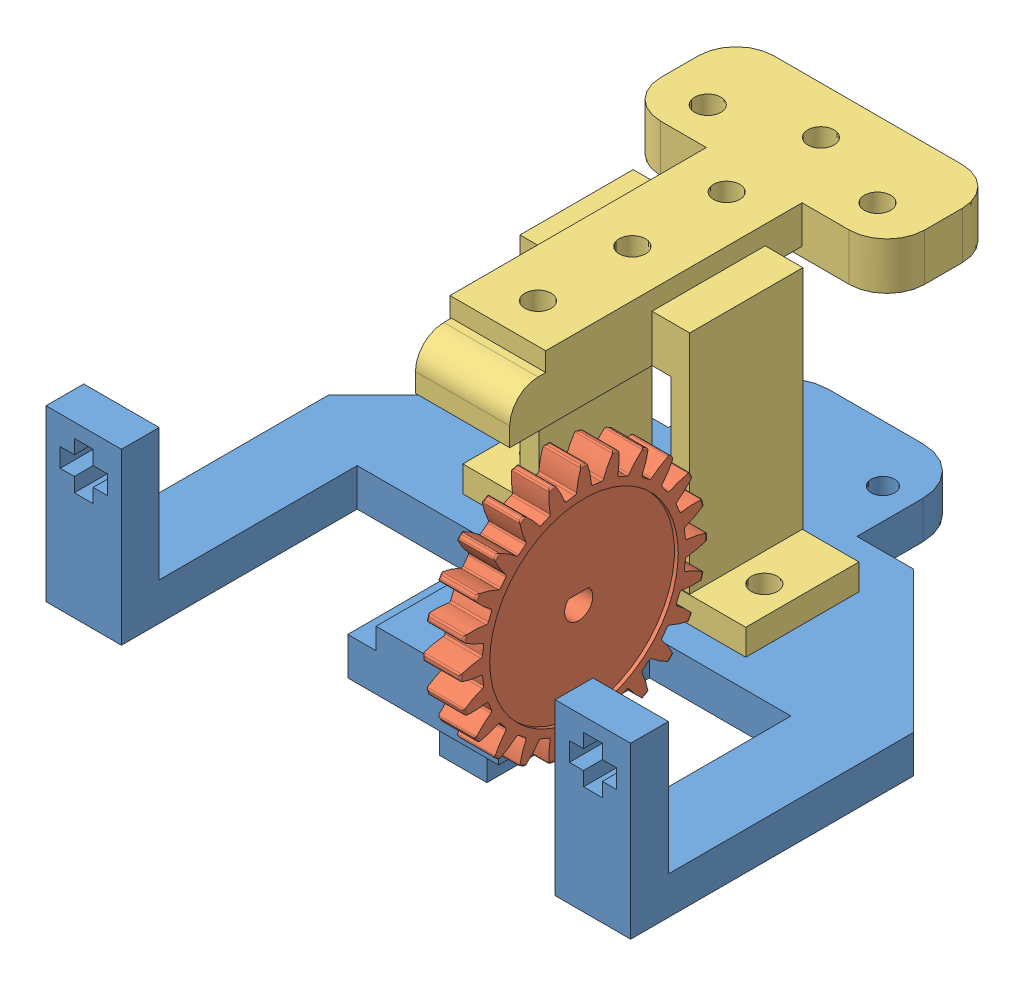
SolidWorks assembly AssemblyBasetoMotor.SLDASM, configuration Default (file format 9000). Lengths in mm.
Overall size (62 41.75 58.34).
4 component instances, 4 part files, 3 mates.
Components (placement in the parent):
- Base2-1: Base2.SLDPRT [Default] at (-42.6877 -17.6867 56.9771) size (62 27 57)
- Pololu Motor-1: Pololu Motor.SLDPRT [Default] at (-47.3877 -5.2867 54.3736) x (0 0 -1) z (1 0 0) (suppressed, hidden)
- x187 OldGray Technic Gear 24 Tooth with Three Axleholes-1: x187 OldGray Technic Gear 24 Tooth with Three Axleholes.SLDPRT [Predeterminado] at (-42.4026 -5.4527 54.2118) x (1 0 0) z (0 0.000566 1) size (4.03 26.2 26.2)
- Base2Cap-1: Base2Cap.SLDPRT [Default] at (-49.4877 5.3133 9.9989) x (0 0 1) z (0 -1 0) size (43 30 29)
Mates (geometry in assembly coordinates):
- Distance1: distance = 3 mm aligned: plane of Pololu Motor-1 through (-47.6877 -5.2867 54.3736) normal (1 0 0); plane of Base2-1 through (-44.6877 -21.6867 8.9771) normal (1 0 0)
- Concentric4: concentric aligned: cylinder of Pololu Motor-1 through (-47.6877 -5.2867 54.3736) axis (1 0 0) radius 1.5; cylinder of x187 OldGray Technic Gear 24 Tooth with Three Axleholes-1 through (-50.8026 -5.2867 54.3736) axis (1 0 0) radius 1.5
- Coincident11: coincident anti-aligned: plane of Base2-1 through (-42.6877 -17.6867 56.9771) normal (0 1 0); plane of Pololu Motor-1 through (-61.4877 -17.6867 22.8736) normal (0 -1 0)
